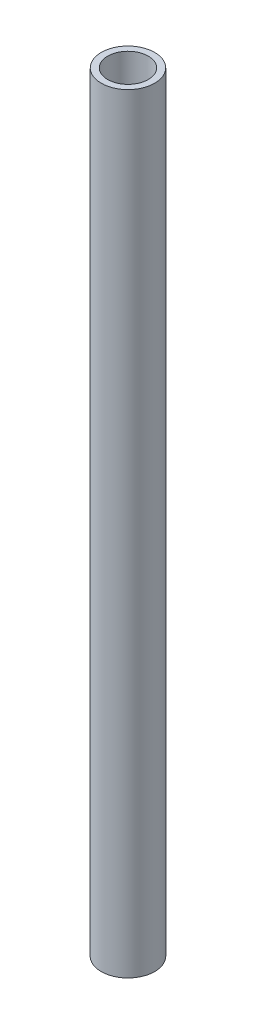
ISO-10303-21;
HEADER;
FILE_DESCRIPTION(('STEP AP214'),'2;1');
FILE_NAME('part.step','',(''),(''),'','','');
FILE_SCHEMA(('AUTOMOTIVE_DESIGN { 1 0 10303 214 1 1 1 1 }'));
ENDSEC;
DATA;
#1=APPLICATION_CONTEXT('core data for automotive mechanical design processes');
#2=APPLICATION_PROTOCOL_DEFINITION('international standard','automotive_design',2000,#1);
#3=PRODUCT_CONTEXT('',#1,'mechanical');
#4=PRODUCT('Part','Part','',(#3));
#5=PRODUCT_RELATED_PRODUCT_CATEGORY('part','',(#4));
#6=PRODUCT_DEFINITION_FORMATION('','',#4);
#7=PRODUCT_DEFINITION_CONTEXT('part definition',#1,'design');
#8=PRODUCT_DEFINITION('design','',#6,#7);
#9=PRODUCT_DEFINITION_SHAPE('','',#8);
#10=(LENGTH_UNIT() NAMED_UNIT(*) SI_UNIT(.MILLI.,.METRE.));
#11=(NAMED_UNIT(*) PLANE_ANGLE_UNIT() SI_UNIT($,.RADIAN.));
#12=(NAMED_UNIT(*) SI_UNIT($,.STERADIAN.) SOLID_ANGLE_UNIT());
#13=UNCERTAINTY_MEASURE_WITH_UNIT(LENGTH_MEASURE(1.E-05),#10,'distance_accuracy_value','');
#14=(GEOMETRIC_REPRESENTATION_CONTEXT(3) GLOBAL_UNCERTAINTY_ASSIGNED_CONTEXT((#13)) GLOBAL_UNIT_ASSIGNED_CONTEXT((#10,
#11,#12)) REPRESENTATION_CONTEXT('',''));
#15=CARTESIAN_POINT('',(0.,0.,0.));
#16=DIRECTION('',(0.,0.,1.));
#17=DIRECTION('',(1.,0.,0.));
#18=AXIS2_PLACEMENT_3D('',#15,#16,#17);
#19=CARTESIAN_POINT('',(0.,-360.,0.));
#20=DIRECTION('',(0.,1.,0.));
#21=DIRECTION('',(0.,0.,1.));
#22=AXIS2_PLACEMENT_3D('',#19,#20,#21);
#23=CYLINDRICAL_SURFACE('',#22,12.5);
#24=CARTESIAN_POINT('',(0.,-360.,0.));
#25=DIRECTION('',(0.,1.,0.));
#26=DIRECTION('',(0.,0.,1.));
#27=AXIS2_PLACEMENT_3D('',#24,#25,#26);
#28=CIRCLE('',#27,12.5);
#29=CARTESIAN_POINT('',(0.,-360.,12.5));
#30=VERTEX_POINT('',#29);
#31=EDGE_CURVE('E10',#30,#30,#28,.T.);
#32=CARTESIAN_POINT('',(0.,0.,0.));
#33=DIRECTION('',(0.,1.,0.));
#34=DIRECTION('',(0.,0.,1.));
#35=AXIS2_PLACEMENT_3D('',#32,#33,#34);
#36=CIRCLE('',#35,12.5);
#37=CARTESIAN_POINT('',(0.,0.,12.5));
#38=VERTEX_POINT('',#37);
#39=EDGE_CURVE('E33',#38,#38,#36,.T.);
#40=CARTESIAN_POINT('',(0.,-360.,12.5));
#41=CARTESIAN_POINT('',(0.,-356.25,12.5));
#42=CARTESIAN_POINT('',(0.,-352.5,12.5));
#43=CARTESIAN_POINT('',(0.,-345.,12.5));
#44=CARTESIAN_POINT('',(0.,-341.25,12.5));
#45=CARTESIAN_POINT('',(0.,-333.75,12.5));
#46=CARTESIAN_POINT('',(0.,-330.,12.5));
#47=CARTESIAN_POINT('',(0.,-322.5,12.5));
#48=CARTESIAN_POINT('',(0.,-318.75,12.5));
#49=CARTESIAN_POINT('',(0.,-311.25,12.5));
#50=CARTESIAN_POINT('',(0.,-307.5,12.5));
#51=CARTESIAN_POINT('',(0.,-300.,12.5));
#52=CARTESIAN_POINT('',(0.,-296.25,12.5));
#53=CARTESIAN_POINT('',(0.,-288.75,12.5));
#54=CARTESIAN_POINT('',(0.,-285.,12.5));
#55=CARTESIAN_POINT('',(0.,-277.5,12.5));
#56=CARTESIAN_POINT('',(0.,-273.75,12.5));
#57=CARTESIAN_POINT('',(0.,-266.25,12.5));
#58=CARTESIAN_POINT('',(0.,-262.5,12.5));
#59=CARTESIAN_POINT('',(0.,-255.,12.5));
#60=CARTESIAN_POINT('',(0.,-251.25,12.5));
#61=CARTESIAN_POINT('',(0.,-243.75,12.5));
#62=CARTESIAN_POINT('',(0.,-240.,12.5));
#63=CARTESIAN_POINT('',(0.,-232.5,12.5));
#64=CARTESIAN_POINT('',(0.,-228.75,12.5));
#65=CARTESIAN_POINT('',(0.,-221.25,12.5));
#66=CARTESIAN_POINT('',(0.,-217.5,12.5));
#67=CARTESIAN_POINT('',(0.,-210.,12.5));
#68=CARTESIAN_POINT('',(0.,-206.25,12.5));
#69=CARTESIAN_POINT('',(0.,-198.75,12.5));
#70=CARTESIAN_POINT('',(0.,-195.,12.5));
#71=CARTESIAN_POINT('',(0.,-187.5,12.5));
#72=CARTESIAN_POINT('',(0.,-183.75,12.5));
#73=CARTESIAN_POINT('',(0.,-176.25,12.5));
#74=CARTESIAN_POINT('',(0.,-172.5,12.5));
#75=CARTESIAN_POINT('',(0.,-165.,12.5));
#76=CARTESIAN_POINT('',(0.,-161.25,12.5));
#77=CARTESIAN_POINT('',(0.,-153.75,12.5));
#78=CARTESIAN_POINT('',(0.,-150.,12.5));
#79=CARTESIAN_POINT('',(0.,-142.5,12.5));
#80=CARTESIAN_POINT('',(0.,-138.75,12.5));
#81=CARTESIAN_POINT('',(0.,-131.25,12.5));
#82=CARTESIAN_POINT('',(0.,-127.5,12.5));
#83=CARTESIAN_POINT('',(0.,-120.,12.5));
#84=CARTESIAN_POINT('',(0.,-116.25,12.5));
#85=CARTESIAN_POINT('',(0.,-108.75,12.5));
#86=CARTESIAN_POINT('',(0.,-105.,12.5));
#87=CARTESIAN_POINT('',(0.,-97.5000000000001,12.5));
#88=CARTESIAN_POINT('',(0.,-93.7500000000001,12.5));
#89=CARTESIAN_POINT('',(0.,-86.2500000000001,12.5));
#90=CARTESIAN_POINT('',(0.,-82.5000000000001,12.5));
#91=CARTESIAN_POINT('',(0.,-75.0000000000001,12.5));
#92=CARTESIAN_POINT('',(0.,-71.25,12.5));
#93=CARTESIAN_POINT('',(0.,-63.7500000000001,12.5));
#94=CARTESIAN_POINT('',(0.,-60.0000000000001,12.5));
#95=CARTESIAN_POINT('',(0.,-52.5000000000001,12.5));
#96=CARTESIAN_POINT('',(0.,-48.75,12.5));
#97=CARTESIAN_POINT('',(0.,-41.25,12.5));
#98=CARTESIAN_POINT('',(0.,-37.5000000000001,12.5));
#99=CARTESIAN_POINT('',(0.,-30.0000000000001,12.5));
#100=CARTESIAN_POINT('',(0.,-26.2500000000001,12.5));
#101=CARTESIAN_POINT('',(0.,-18.7500000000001,12.5));
#102=CARTESIAN_POINT('',(0.,-15.,12.5));
#103=CARTESIAN_POINT('',(0.,-7.50000000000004,12.5));
#104=CARTESIAN_POINT('',(0.,-3.75000000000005,12.5));
#105=CARTESIAN_POINT('',(0.,0.,12.5));
#106=B_SPLINE_CURVE_WITH_KNOTS('',3,(#40,#41,#42,#43,#44,#45,#46,#47,#48,#49,#50,#51,#52,#53,
#54,#55,#56,#57,#58,#59,#60,#61,#62,#63,#64,#65,#66,#67,#68,#69,#70,#71,#72,#73,#74,#75,#76,#77,
#78,#79,#80,#81,#82,#83,#84,#85,#86,#87,#88,#89,#90,#91,#92,#93,#94,#95,#96,#97,#98,#99,#100,
#101,#102,#103,#104,#105),.UNSPECIFIED.,.F.,.F.,(4,2,2,2,2,2,2,2,2,2,2,2,2,2,2,2,2,2,2,2,2,2,2,
2,2,2,2,2,2,2,2,2,4),(0.,11.25,22.5,33.75,45.,56.25,67.5,78.75,90.,101.25,112.5,123.75,135.,
146.25,157.5,168.75,180.,191.25,202.5,213.75,225.,236.25,247.5,258.75,270.,281.25,292.5,303.75,
315.,326.25,337.5,348.75,360.),.UNSPECIFIED.);
#107=EDGE_CURVE('BSEAM30',#30,#38,#106,.T.);
#108=ORIENTED_EDGE('',*,*,#31,.T.);
#109=ORIENTED_EDGE('',*,*,#39,.F.);
#110=ORIENTED_EDGE('',*,*,#107,.T.);
#111=ORIENTED_EDGE('',*,*,#107,.F.);
#112=EDGE_LOOP('',(#108,#110,#109,#111));
#113=FACE_BOUND('',#112,.T.);
#114=ADVANCED_FACE('F30',(#113),#23,.T.);
#115=CARTESIAN_POINT('',(0.,-360.,0.));
#116=DIRECTION('',(0.,1.,0.));
#117=DIRECTION('',(0.,0.,1.));
#118=AXIS2_PLACEMENT_3D('',#115,#116,#117);
#119=PLANE('',#118);
#120=CARTESIAN_POINT('',(0.,-360.,0.));
#121=DIRECTION('',(0.,1.,0.));
#122=DIRECTION('',(0.,0.,1.));
#123=AXIS2_PLACEMENT_3D('',#120,#121,#122);
#124=CIRCLE('',#123,9.5);
#125=CARTESIAN_POINT('',(0.,-360.,9.5));
#126=VERTEX_POINT('',#125);
#127=EDGE_CURVE('E40',#126,#126,#124,.T.);
#128=ORIENTED_EDGE('',*,*,#127,.T.);
#129=EDGE_LOOP('',(#128));
#130=FACE_BOUND('',#129,.T.);
#131=ORIENTED_EDGE('',*,*,#31,.F.);
#132=EDGE_LOOP('',(#131));
#133=FACE_BOUND('',#132,.T.);
#134=ADVANCED_FACE('F48',(#130,#133),#119,.F.);
#135=CARTESIAN_POINT('',(0.,0.,0.));
#136=DIRECTION('',(0.,1.,0.));
#137=DIRECTION('',(0.,0.,1.));
#138=AXIS2_PLACEMENT_3D('',#135,#136,#137);
#139=PLANE('',#138);
#140=CARTESIAN_POINT('',(0.,0.,0.));
#141=DIRECTION('',(0.,1.,0.));
#142=DIRECTION('',(0.,0.,1.));
#143=AXIS2_PLACEMENT_3D('',#140,#141,#142);
#144=CIRCLE('',#143,9.5);
#145=CARTESIAN_POINT('',(0.,0.,9.5));
#146=VERTEX_POINT('',#145);
#147=EDGE_CURVE('E42',#146,#146,#144,.T.);
#148=ORIENTED_EDGE('',*,*,#147,.F.);
#149=EDGE_LOOP('',(#148));
#150=FACE_BOUND('',#149,.T.);
#151=ORIENTED_EDGE('',*,*,#39,.T.);
#152=EDGE_LOOP('',(#151));
#153=FACE_BOUND('',#152,.T.);
#154=ADVANCED_FACE('F54',(#150,#153),#139,.T.);
#155=CARTESIAN_POINT('',(0.,-360.,0.));
#156=DIRECTION('',(0.,1.,0.));
#157=DIRECTION('',(0.,0.,1.));
#158=AXIS2_PLACEMENT_3D('',#155,#156,#157);
#159=CYLINDRICAL_SURFACE('',#158,9.5);
#160=CARTESIAN_POINT('',(0.,-360.,9.5));
#161=CARTESIAN_POINT('',(0.,-356.25,9.5));
#162=CARTESIAN_POINT('',(0.,-352.5,9.5));
#163=CARTESIAN_POINT('',(0.,-345.,9.5));
#164=CARTESIAN_POINT('',(0.,-341.25,9.5));
#165=CARTESIAN_POINT('',(0.,-333.75,9.5));
#166=CARTESIAN_POINT('',(0.,-330.,9.5));
#167=CARTESIAN_POINT('',(0.,-322.5,9.5));
#168=CARTESIAN_POINT('',(0.,-318.75,9.5));
#169=CARTESIAN_POINT('',(0.,-311.25,9.5));
#170=CARTESIAN_POINT('',(0.,-307.5,9.5));
#171=CARTESIAN_POINT('',(0.,-300.,9.5));
#172=CARTESIAN_POINT('',(0.,-296.25,9.5));
#173=CARTESIAN_POINT('',(0.,-288.75,9.5));
#174=CARTESIAN_POINT('',(0.,-285.,9.5));
#175=CARTESIAN_POINT('',(0.,-277.5,9.5));
#176=CARTESIAN_POINT('',(0.,-273.75,9.5));
#177=CARTESIAN_POINT('',(0.,-266.25,9.5));
#178=CARTESIAN_POINT('',(0.,-262.5,9.5));
#179=CARTESIAN_POINT('',(0.,-255.,9.5));
#180=CARTESIAN_POINT('',(0.,-251.25,9.5));
#181=CARTESIAN_POINT('',(0.,-243.75,9.5));
#182=CARTESIAN_POINT('',(0.,-240.,9.5));
#183=CARTESIAN_POINT('',(0.,-232.5,9.5));
#184=CARTESIAN_POINT('',(0.,-228.75,9.5));
#185=CARTESIAN_POINT('',(0.,-221.25,9.5));
#186=CARTESIAN_POINT('',(0.,-217.5,9.5));
#187=CARTESIAN_POINT('',(0.,-210.,9.5));
#188=CARTESIAN_POINT('',(0.,-206.25,9.5));
#189=CARTESIAN_POINT('',(0.,-198.75,9.5));
#190=CARTESIAN_POINT('',(0.,-195.,9.5));
#191=CARTESIAN_POINT('',(0.,-187.5,9.5));
#192=CARTESIAN_POINT('',(0.,-183.75,9.5));
#193=CARTESIAN_POINT('',(0.,-176.25,9.5));
#194=CARTESIAN_POINT('',(0.,-172.5,9.5));
#195=CARTESIAN_POINT('',(0.,-165.,9.5));
#196=CARTESIAN_POINT('',(0.,-161.25,9.5));
#197=CARTESIAN_POINT('',(0.,-153.75,9.5));
#198=CARTESIAN_POINT('',(0.,-150.,9.5));
#199=CARTESIAN_POINT('',(0.,-142.5,9.5));
#200=CARTESIAN_POINT('',(0.,-138.75,9.5));
#201=CARTESIAN_POINT('',(0.,-131.25,9.5));
#202=CARTESIAN_POINT('',(0.,-127.5,9.5));
#203=CARTESIAN_POINT('',(0.,-120.,9.5));
#204=CARTESIAN_POINT('',(0.,-116.25,9.5));
#205=CARTESIAN_POINT('',(0.,-108.75,9.5));
#206=CARTESIAN_POINT('',(0.,-105.,9.5));
#207=CARTESIAN_POINT('',(0.,-97.5,9.5));
#208=CARTESIAN_POINT('',(0.,-93.75,9.5));
#209=CARTESIAN_POINT('',(0.,-86.25,9.5));
#210=CARTESIAN_POINT('',(0.,-82.5,9.5));
#211=CARTESIAN_POINT('',(0.,-75.0000000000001,9.5));
#212=CARTESIAN_POINT('',(0.,-71.25,9.5));
#213=CARTESIAN_POINT('',(0.,-63.7500000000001,9.5));
#214=CARTESIAN_POINT('',(0.,-60.0000000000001,9.5));
#215=CARTESIAN_POINT('',(0.,-52.5000000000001,9.5));
#216=CARTESIAN_POINT('',(0.,-48.75,9.5));
#217=CARTESIAN_POINT('',(0.,-41.25,9.5));
#218=CARTESIAN_POINT('',(0.,-37.5000000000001,9.5));
#219=CARTESIAN_POINT('',(0.,-30.0000000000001,9.5));
#220=CARTESIAN_POINT('',(0.,-26.2500000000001,9.5));
#221=CARTESIAN_POINT('',(0.,-18.7500000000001,9.5));
#222=CARTESIAN_POINT('',(0.,-15.,9.5));
#223=CARTESIAN_POINT('',(0.,-7.50000000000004,9.5));
#224=CARTESIAN_POINT('',(0.,-3.75000000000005,9.5));
#225=CARTESIAN_POINT('',(0.,0.,9.5));
#226=B_SPLINE_CURVE_WITH_KNOTS('',3,(#160,#161,#162,#163,#164,#165,#166,#167,#168,#169,#170,
#171,#172,#173,#174,#175,#176,#177,#178,#179,#180,#181,#182,#183,#184,#185,#186,#187,#188,#189,
#190,#191,#192,#193,#194,#195,#196,#197,#198,#199,#200,#201,#202,#203,#204,#205,#206,#207,#208,
#209,#210,#211,#212,#213,#214,#215,#216,#217,#218,#219,#220,#221,#222,#223,#224,#225),
.UNSPECIFIED.,.F.,.F.,(4,2,2,2,2,2,2,2,2,2,2,2,2,2,2,2,2,2,2,2,2,2,2,2,2,2,2,2,2,2,2,2,4),(0.,
11.25,22.5,33.7499999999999,45.,56.25,67.4999999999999,78.75,90.,101.25,112.5,123.75,135.,
146.25,157.5,168.75,180.,191.25,202.5,213.75,225.,236.25,247.5,258.75,270.,281.25,292.5,303.75,
315.,326.25,337.5,348.75,360.),.UNSPECIFIED.);
#227=EDGE_CURVE('BSEAM51',#126,#146,#226,.T.);
#228=ORIENTED_EDGE('',*,*,#127,.F.);
#229=ORIENTED_EDGE('',*,*,#147,.T.);
#230=ORIENTED_EDGE('',*,*,#227,.T.);
#231=ORIENTED_EDGE('',*,*,#227,.F.);
#232=EDGE_LOOP('',(#228,#230,#229,#231));
#233=FACE_BOUND('',#232,.T.);
#234=ADVANCED_FACE('F51',(#233),#159,.F.);
#235=CLOSED_SHELL('',(#114,#134,#154,#234));
#236=MANIFOLD_SOLID_BREP('B2',#235);
#237=ADVANCED_BREP_SHAPE_REPRESENTATION('',(#18,#236),#14);
#238=SHAPE_DEFINITION_REPRESENTATION(#9,#237);
ENDSEC;
END-ISO-10303-21;
